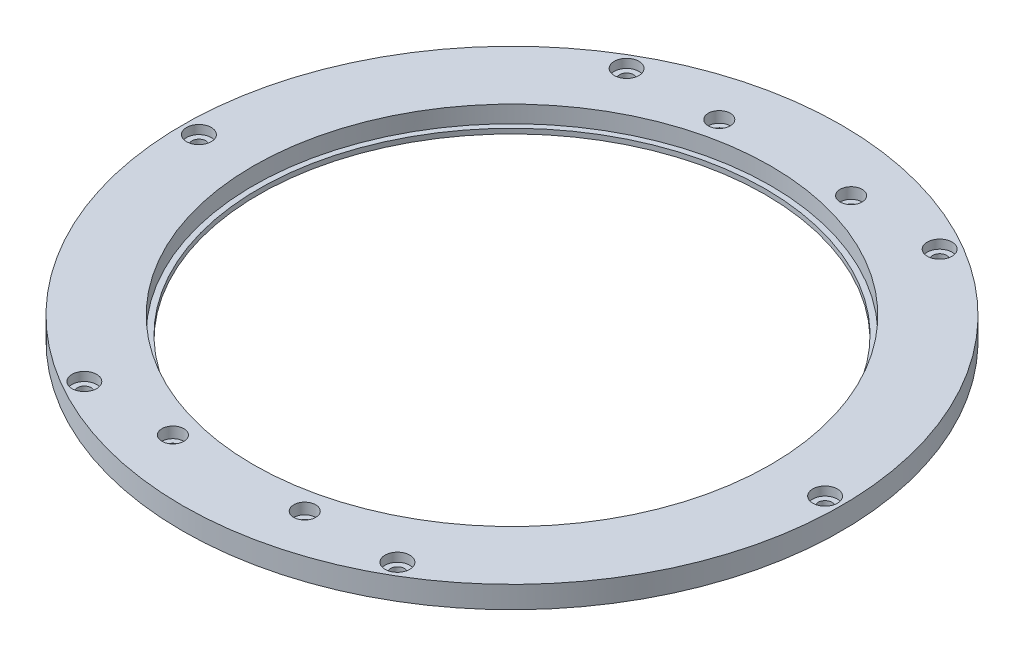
ISO-10303-21;
HEADER;
FILE_DESCRIPTION(('STEP AP214'),'2;1');
FILE_NAME('part.step','',(''),(''),'','','');
FILE_SCHEMA(('AUTOMOTIVE_DESIGN { 1 0 10303 214 1 1 1 1 }'));
ENDSEC;
DATA;
#1=APPLICATION_CONTEXT('core data for automotive mechanical design processes');
#2=APPLICATION_PROTOCOL_DEFINITION('international standard','automotive_design',2000,#1);
#3=PRODUCT_CONTEXT('',#1,'mechanical');
#4=PRODUCT('Part','Part','',(#3));
#5=PRODUCT_RELATED_PRODUCT_CATEGORY('part','',(#4));
#6=PRODUCT_DEFINITION_FORMATION('','',#4);
#7=PRODUCT_DEFINITION_CONTEXT('part definition',#1,'design');
#8=PRODUCT_DEFINITION('design','',#6,#7);
#9=PRODUCT_DEFINITION_SHAPE('','',#8);
#10=(LENGTH_UNIT() NAMED_UNIT(*) SI_UNIT(.MILLI.,.METRE.));
#11=(NAMED_UNIT(*) PLANE_ANGLE_UNIT() SI_UNIT($,.RADIAN.));
#12=(NAMED_UNIT(*) SI_UNIT($,.STERADIAN.) SOLID_ANGLE_UNIT());
#13=UNCERTAINTY_MEASURE_WITH_UNIT(LENGTH_MEASURE(1.E-05),#10,'distance_accuracy_value','');
#14=(GEOMETRIC_REPRESENTATION_CONTEXT(3) GLOBAL_UNCERTAINTY_ASSIGNED_CONTEXT((#13)) GLOBAL_UNIT_ASSIGNED_CONTEXT((#10,
#11,#12)) REPRESENTATION_CONTEXT('',''));
#15=CARTESIAN_POINT('',(0.,0.,0.));
#16=DIRECTION('',(0.,0.,1.));
#17=DIRECTION('',(1.,0.,0.));
#18=AXIS2_PLACEMENT_3D('',#15,#16,#17);
#19=CARTESIAN_POINT('',(-11.9999999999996,4.,-49.7359346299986));
#20=DIRECTION('',(0.,-1.,0.));
#21=DIRECTION('',(0.,0.,-1.));
#22=AXIS2_PLACEMENT_3D('',#19,#20,#21);
#23=CYLINDRICAL_SURFACE('',#22,1.00000000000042);
#24=CARTESIAN_POINT('',(-11.9999999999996,0.,-49.7359346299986));
#25=DIRECTION('',(0.,-1.,0.));
#26=DIRECTION('',(0.,0.,-1.));
#27=AXIS2_PLACEMENT_3D('',#24,#25,#26);
#28=CIRCLE('',#27,1.00000000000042);
#29=CARTESIAN_POINT('',(-11.9999999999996,0.,-50.735934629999));
#30=VERTEX_POINT('',#29);
#31=EDGE_CURVE('E100',#30,#30,#28,.T.);
#32=ORIENTED_EDGE('',*,*,#31,.T.);
#33=EDGE_LOOP('',(#32));
#34=FACE_BOUND('',#33,.T.);
#35=CARTESIAN_POINT('',(-11.9999999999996,2.,-49.7359346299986));
#36=DIRECTION('',(0.,1.,0.));
#37=DIRECTION('',(0.,0.,1.));
#38=AXIS2_PLACEMENT_3D('',#35,#36,#37);
#39=CIRCLE('',#38,1.00000000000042);
#40=CARTESIAN_POINT('',(-11.9999999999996,2.,-48.7359346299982));
#41=VERTEX_POINT('',#40);
#42=EDGE_CURVE('E39',#41,#41,#39,.F.);
#43=ORIENTED_EDGE('',*,*,#42,.F.);
#44=EDGE_LOOP('',(#43));
#45=FACE_BOUND('',#44,.T.);
#46=ADVANCED_FACE('F35',(#34,#45),#23,.F.);
#47=CARTESIAN_POINT('',(12.0000000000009,4.,49.7359346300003));
#48=DIRECTION('',(0.,-1.,0.));
#49=DIRECTION('',(0.,0.,-1.));
#50=AXIS2_PLACEMENT_3D('',#47,#48,#49);
#51=CYLINDRICAL_SURFACE('',#50,1.);
#52=CARTESIAN_POINT('',(12.0000000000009,0.,49.7359346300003));
#53=DIRECTION('',(0.,-1.,0.));
#54=DIRECTION('',(0.,0.,-1.));
#55=AXIS2_PLACEMENT_3D('',#52,#53,#54);
#56=CIRCLE('',#55,1.);
#57=CARTESIAN_POINT('',(12.0000000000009,0.,48.7359346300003));
#58=VERTEX_POINT('',#57);
#59=EDGE_CURVE('E84',#58,#58,#56,.T.);
#60=ORIENTED_EDGE('',*,*,#59,.T.);
#61=EDGE_LOOP('',(#60));
#62=FACE_BOUND('',#61,.T.);
#63=CARTESIAN_POINT('',(12.0000000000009,2.,49.7359346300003));
#64=DIRECTION('',(0.,1.,0.));
#65=DIRECTION('',(0.,0.,1.));
#66=AXIS2_PLACEMENT_3D('',#63,#64,#65);
#67=CIRCLE('',#66,1.);
#68=CARTESIAN_POINT('',(12.0000000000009,2.,50.7359346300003));
#69=VERTEX_POINT('',#68);
#70=EDGE_CURVE('E79',#69,#69,#67,.F.);
#71=ORIENTED_EDGE('',*,*,#70,.F.);
#72=EDGE_LOOP('',(#71));
#73=FACE_BOUND('',#72,.T.);
#74=ADVANCED_FACE('F187',(#62,#73),#51,.F.);
#75=CARTESIAN_POINT('',(-11.9999999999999,4.,49.7359346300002));
#76=DIRECTION('',(0.,-1.,0.));
#77=DIRECTION('',(0.,0.,-1.));
#78=AXIS2_PLACEMENT_3D('',#75,#76,#77);
#79=CYLINDRICAL_SURFACE('',#78,0.999999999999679);
#80=CARTESIAN_POINT('',(-11.9999999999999,0.,49.7359346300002));
#81=DIRECTION('',(0.,-1.,0.));
#82=DIRECTION('',(0.,0.,-1.));
#83=AXIS2_PLACEMENT_3D('',#80,#81,#82);
#84=CIRCLE('',#83,0.999999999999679);
#85=CARTESIAN_POINT('',(-11.9999999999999,0.,48.7359346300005));
#86=VERTEX_POINT('',#85);
#87=EDGE_CURVE('E88',#86,#86,#84,.T.);
#88=ORIENTED_EDGE('',*,*,#87,.T.);
#89=EDGE_LOOP('',(#88));
#90=FACE_BOUND('',#89,.T.);
#91=CARTESIAN_POINT('',(-11.9999999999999,2.,49.7359346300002));
#92=DIRECTION('',(0.,1.,0.));
#93=DIRECTION('',(0.,0.,1.));
#94=AXIS2_PLACEMENT_3D('',#91,#92,#93);
#95=CIRCLE('',#94,0.999999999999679);
#96=CARTESIAN_POINT('',(-11.9999999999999,2.,50.7359346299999));
#97=VERTEX_POINT('',#96);
#98=EDGE_CURVE('E76',#97,#97,#95,.F.);
#99=ORIENTED_EDGE('',*,*,#98,.F.);
#100=EDGE_LOOP('',(#99));
#101=FACE_BOUND('',#100,.T.);
#102=ADVANCED_FACE('F193',(#90,#101),#79,.F.);
#103=CARTESIAN_POINT('',(12.0000000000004,4.,-49.7359346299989));
#104=DIRECTION('',(0.,-1.,0.));
#105=DIRECTION('',(0.,0.,-1.));
#106=AXIS2_PLACEMENT_3D('',#103,#104,#105);
#107=CYLINDRICAL_SURFACE('',#106,1.00000000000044);
#108=CARTESIAN_POINT('',(12.0000000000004,0.,-49.7359346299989));
#109=DIRECTION('',(0.,-1.,0.));
#110=DIRECTION('',(0.,0.,-1.));
#111=AXIS2_PLACEMENT_3D('',#108,#109,#110);
#112=CIRCLE('',#111,1.00000000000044);
#113=CARTESIAN_POINT('',(12.0000000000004,0.,-50.7359346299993));
#114=VERTEX_POINT('',#113);
#115=EDGE_CURVE('E93',#114,#114,#112,.T.);
#116=ORIENTED_EDGE('',*,*,#115,.T.);
#117=EDGE_LOOP('',(#116));
#118=FACE_BOUND('',#117,.T.);
#119=CARTESIAN_POINT('',(12.0000000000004,2.,-49.7359346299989));
#120=DIRECTION('',(0.,1.,0.));
#121=DIRECTION('',(0.,0.,1.));
#122=AXIS2_PLACEMENT_3D('',#119,#120,#121);
#123=CIRCLE('',#122,1.00000000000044);
#124=CARTESIAN_POINT('',(12.0000000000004,2.,-48.7359346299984));
#125=VERTEX_POINT('',#124);
#126=EDGE_CURVE('E73',#125,#125,#123,.F.);
#127=ORIENTED_EDGE('',*,*,#126,.F.);
#128=EDGE_LOOP('',(#127));
#129=FACE_BOUND('',#128,.T.);
#130=ADVANCED_FACE('F271',(#118,#129),#107,.F.);
#131=CARTESIAN_POINT('',(-28.4999999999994,4.,49.3634480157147));
#132=DIRECTION('',(0.,-1.,0.));
#133=DIRECTION('',(0.,0.,-1.));
#134=AXIS2_PLACEMENT_3D('',#131,#132,#133);
#135=CYLINDRICAL_SURFACE('',#134,1.25);
#136=CARTESIAN_POINT('',(-28.4999999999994,0.,49.3634480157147));
#137=DIRECTION('',(0.,-1.,0.));
#138=DIRECTION('',(0.,0.,-1.));
#139=AXIS2_PLACEMENT_3D('',#136,#137,#138);
#140=CIRCLE('',#139,1.25);
#141=CARTESIAN_POINT('',(-28.4999999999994,0.,48.1134480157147));
#142=VERTEX_POINT('',#141);
#143=EDGE_CURVE('E142',#142,#142,#140,.T.);
#144=ORIENTED_EDGE('',*,*,#143,.T.);
#145=EDGE_LOOP('',(#144));
#146=FACE_BOUND('',#145,.T.);
#147=CARTESIAN_POINT('',(-28.4999999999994,2.4,49.3634480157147));
#148=DIRECTION('',(0.,1.,0.));
#149=DIRECTION('',(0.,0.,1.));
#150=AXIS2_PLACEMENT_3D('',#147,#148,#149);
#151=CIRCLE('',#150,1.25);
#152=CARTESIAN_POINT('',(-28.4999999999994,2.4,50.6134480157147));
#153=VERTEX_POINT('',#152);
#154=EDGE_CURVE('E69',#153,#153,#151,.F.);
#155=ORIENTED_EDGE('',*,*,#154,.F.);
#156=EDGE_LOOP('',(#155));
#157=FACE_BOUND('',#156,.T.);
#158=ADVANCED_FACE('F253',(#146,#157),#135,.F.);
#159=CARTESIAN_POINT('',(-56.9999999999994,4.,1.72084568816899E-12));
#160=DIRECTION('',(0.,-1.,0.));
#161=DIRECTION('',(0.,0.,-1.));
#162=AXIS2_PLACEMENT_3D('',#159,#160,#161);
#163=CYLINDRICAL_SURFACE('',#162,1.25);
#164=CARTESIAN_POINT('',(-56.9999999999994,0.,1.72084568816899E-12));
#165=DIRECTION('',(0.,-1.,0.));
#166=DIRECTION('',(0.,0.,-1.));
#167=AXIS2_PLACEMENT_3D('',#164,#165,#166);
#168=CIRCLE('',#167,1.25);
#169=CARTESIAN_POINT('',(-56.9999999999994,0.,-1.24999999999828));
#170=VERTEX_POINT('',#169);
#171=EDGE_CURVE('E139',#170,#170,#168,.T.);
#172=ORIENTED_EDGE('',*,*,#171,.T.);
#173=EDGE_LOOP('',(#172));
#174=FACE_BOUND('',#173,.T.);
#175=CARTESIAN_POINT('',(-56.9999999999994,2.4,1.72084568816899E-12));
#176=DIRECTION('',(0.,1.,0.));
#177=DIRECTION('',(0.,0.,1.));
#178=AXIS2_PLACEMENT_3D('',#175,#176,#177);
#179=CIRCLE('',#178,1.25);
#180=CARTESIAN_POINT('',(-56.9999999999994,2.4,1.25000000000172));
#181=VERTEX_POINT('',#180);
#182=EDGE_CURVE('E66',#181,#181,#179,.F.);
#183=ORIENTED_EDGE('',*,*,#182,.F.);
#184=EDGE_LOOP('',(#183));
#185=FACE_BOUND('',#184,.T.);
#186=ADVANCED_FACE('F249',(#174,#185),#163,.F.);
#187=CARTESIAN_POINT('',(-28.4999999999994,4.,-49.3634480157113));
#188=DIRECTION('',(0.,-1.,0.));
#189=DIRECTION('',(0.,0.,-1.));
#190=AXIS2_PLACEMENT_3D('',#187,#188,#189);
#191=CYLINDRICAL_SURFACE('',#190,1.25);
#192=CARTESIAN_POINT('',(-28.4999999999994,0.,-49.3634480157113));
#193=DIRECTION('',(0.,-1.,0.));
#194=DIRECTION('',(0.,0.,-1.));
#195=AXIS2_PLACEMENT_3D('',#192,#193,#194);
#196=CIRCLE('',#195,1.25);
#197=CARTESIAN_POINT('',(-28.4999999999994,0.,-50.6134480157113));
#198=VERTEX_POINT('',#197);
#199=EDGE_CURVE('E143',#198,#198,#196,.T.);
#200=ORIENTED_EDGE('',*,*,#199,.T.);
#201=EDGE_LOOP('',(#200));
#202=FACE_BOUND('',#201,.T.);
#203=CARTESIAN_POINT('',(-28.4999999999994,2.4,-49.3634480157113));
#204=DIRECTION('',(0.,1.,0.));
#205=DIRECTION('',(0.,0.,1.));
#206=AXIS2_PLACEMENT_3D('',#203,#204,#205);
#207=CIRCLE('',#206,1.25);
#208=CARTESIAN_POINT('',(-28.4999999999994,2.4,-48.1134480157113));
#209=VERTEX_POINT('',#208);
#210=EDGE_CURVE('E63',#209,#209,#207,.F.);
#211=ORIENTED_EDGE('',*,*,#210,.F.);
#212=EDGE_LOOP('',(#211));
#213=FACE_BOUND('',#212,.T.);
#214=ADVANCED_FACE('F252',(#202,#213),#191,.F.);
#215=CARTESIAN_POINT('',(28.5000000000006,4.,-49.3634480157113));
#216=DIRECTION('',(0.,-1.,0.));
#217=DIRECTION('',(0.,0.,-1.));
#218=AXIS2_PLACEMENT_3D('',#215,#216,#217);
#219=CYLINDRICAL_SURFACE('',#218,1.25);
#220=CARTESIAN_POINT('',(28.5000000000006,0.,-49.3634480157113));
#221=DIRECTION('',(0.,-1.,0.));
#222=DIRECTION('',(0.,0.,-1.));
#223=AXIS2_PLACEMENT_3D('',#220,#221,#222);
#224=CIRCLE('',#223,1.25);
#225=CARTESIAN_POINT('',(28.5000000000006,0.,-50.6134480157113));
#226=VERTEX_POINT('',#225);
#227=EDGE_CURVE('E146',#226,#226,#224,.T.);
#228=ORIENTED_EDGE('',*,*,#227,.T.);
#229=EDGE_LOOP('',(#228));
#230=FACE_BOUND('',#229,.T.);
#231=CARTESIAN_POINT('',(28.5000000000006,2.4,-49.3634480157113));
#232=DIRECTION('',(0.,1.,0.));
#233=DIRECTION('',(0.,0.,1.));
#234=AXIS2_PLACEMENT_3D('',#231,#232,#233);
#235=CIRCLE('',#234,1.25);
#236=CARTESIAN_POINT('',(28.5000000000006,2.4,-48.1134480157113));
#237=VERTEX_POINT('',#236);
#238=EDGE_CURVE('E60',#237,#237,#235,.F.);
#239=ORIENTED_EDGE('',*,*,#238,.F.);
#240=EDGE_LOOP('',(#239));
#241=FACE_BOUND('',#240,.T.);
#242=ADVANCED_FACE('F257',(#230,#241),#219,.F.);
#243=CARTESIAN_POINT('',(57.0000000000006,4.,1.71390679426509E-12));
#244=DIRECTION('',(0.,-1.,0.));
#245=DIRECTION('',(0.,0.,-1.));
#246=AXIS2_PLACEMENT_3D('',#243,#244,#245);
#247=CYLINDRICAL_SURFACE('',#246,1.25);
#248=CARTESIAN_POINT('',(57.0000000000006,0.,1.71390679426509E-12));
#249=DIRECTION('',(0.,-1.,0.));
#250=DIRECTION('',(0.,0.,-1.));
#251=AXIS2_PLACEMENT_3D('',#248,#249,#250);
#252=CIRCLE('',#251,1.25);
#253=CARTESIAN_POINT('',(57.0000000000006,0.,-1.24999999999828));
#254=VERTEX_POINT('',#253);
#255=EDGE_CURVE('E149',#254,#254,#252,.T.);
#256=ORIENTED_EDGE('',*,*,#255,.T.);
#257=EDGE_LOOP('',(#256));
#258=FACE_BOUND('',#257,.T.);
#259=CARTESIAN_POINT('',(57.0000000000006,2.4,1.71390679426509E-12));
#260=DIRECTION('',(0.,1.,0.));
#261=DIRECTION('',(0.,0.,1.));
#262=AXIS2_PLACEMENT_3D('',#259,#260,#261);
#263=CIRCLE('',#262,1.25);
#264=CARTESIAN_POINT('',(57.0000000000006,2.4,1.25000000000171));
#265=VERTEX_POINT('',#264);
#266=EDGE_CURVE('E56',#265,#265,#263,.F.);
#267=ORIENTED_EDGE('',*,*,#266,.F.);
#268=EDGE_LOOP('',(#267));
#269=FACE_BOUND('',#268,.T.);
#270=ADVANCED_FACE('F261',(#258,#269),#247,.F.);
#271=CARTESIAN_POINT('',(28.5000000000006,4.,49.3634480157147));
#272=DIRECTION('',(0.,-1.,0.));
#273=DIRECTION('',(0.,0.,-1.));
#274=AXIS2_PLACEMENT_3D('',#271,#272,#273);
#275=CYLINDRICAL_SURFACE('',#274,1.25);
#276=CARTESIAN_POINT('',(28.5000000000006,0.,49.3634480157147));
#277=DIRECTION('',(0.,-1.,0.));
#278=DIRECTION('',(0.,0.,-1.));
#279=AXIS2_PLACEMENT_3D('',#276,#277,#278);
#280=CIRCLE('',#279,1.25);
#281=CARTESIAN_POINT('',(28.5000000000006,0.,48.1134480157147));
#282=VERTEX_POINT('',#281);
#283=EDGE_CURVE('E72',#282,#282,#280,.T.);
#284=ORIENTED_EDGE('',*,*,#283,.T.);
#285=EDGE_LOOP('',(#284));
#286=FACE_BOUND('',#285,.T.);
#287=CARTESIAN_POINT('',(28.5000000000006,2.4,49.3634480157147));
#288=DIRECTION('',(0.,1.,0.));
#289=DIRECTION('',(0.,0.,1.));
#290=AXIS2_PLACEMENT_3D('',#287,#288,#289);
#291=CIRCLE('',#290,1.25);
#292=CARTESIAN_POINT('',(28.5000000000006,2.4,50.6134480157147));
#293=VERTEX_POINT('',#292);
#294=EDGE_CURVE('E53',#293,#293,#291,.F.);
#295=ORIENTED_EDGE('',*,*,#294,.F.);
#296=EDGE_LOOP('',(#295));
#297=FACE_BOUND('',#296,.T.);
#298=ADVANCED_FACE('F182',(#286,#297),#275,.F.);
#299=CARTESIAN_POINT('',(0.,4.,0.));
#300=DIRECTION('',(0.,-1.,0.));
#301=DIRECTION('',(0.,0.,-1.));
#302=AXIS2_PLACEMENT_3D('',#299,#300,#301);
#303=CYLINDRICAL_SURFACE('',#302,47.1);
#304=CARTESIAN_POINT('',(0.,4.,0.));
#305=DIRECTION('',(0.,1.,0.));
#306=DIRECTION('',(0.,0.,1.));
#307=AXIS2_PLACEMENT_3D('',#304,#305,#306);
#308=CIRCLE('',#307,47.1);
#309=CARTESIAN_POINT('',(0.,4.,47.1));
#310=VERTEX_POINT('',#309);
#311=EDGE_CURVE('E48',#310,#310,#308,.T.);
#312=ORIENTED_EDGE('',*,*,#311,.T.);
#313=EDGE_LOOP('',(#312));
#314=FACE_BOUND('',#313,.T.);
#315=CARTESIAN_POINT('',(0.,0.9,0.));
#316=DIRECTION('',(0.,-1.,0.));
#317=DIRECTION('',(0.,0.,-1.));
#318=AXIS2_PLACEMENT_3D('',#315,#316,#317);
#319=CIRCLE('',#318,47.1);
#320=CARTESIAN_POINT('',(0.,0.9,-47.1));
#321=VERTEX_POINT('',#320);
#322=EDGE_CURVE('E160',#321,#321,#319,.T.);
#323=ORIENTED_EDGE('',*,*,#322,.T.);
#324=EDGE_LOOP('',(#323));
#325=FACE_BOUND('',#324,.T.);
#326=ADVANCED_FACE('F168',(#314,#325),#303,.F.);
#327=CARTESIAN_POINT('',(0.,4.,0.));
#328=DIRECTION('',(0.,1.,0.));
#329=DIRECTION('',(0.,0.,1.));
#330=AXIS2_PLACEMENT_3D('',#327,#328,#329);
#331=PLANE('',#330);
#332=CARTESIAN_POINT('',(12.0000000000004,4.,-49.7359346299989));
#333=DIRECTION('',(0.,1.,0.));
#334=DIRECTION('',(0.,0.,1.));
#335=AXIS2_PLACEMENT_3D('',#332,#333,#334);
#336=CIRCLE('',#335,2.);
#337=CARTESIAN_POINT('',(12.0000000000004,4.,-47.7359346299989));
#338=VERTEX_POINT('',#337);
#339=EDGE_CURVE('E502',#338,#338,#336,.T.);
#340=ORIENTED_EDGE('',*,*,#339,.F.);
#341=EDGE_LOOP('',(#340));
#342=FACE_BOUND('',#341,.T.);
#343=CARTESIAN_POINT('',(-11.9999999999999,4.,49.7359346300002));
#344=DIRECTION('',(0.,1.,0.));
#345=DIRECTION('',(0.,0.,1.));
#346=AXIS2_PLACEMENT_3D('',#343,#344,#345);
#347=CIRCLE('',#346,2.);
#348=CARTESIAN_POINT('',(-11.9999999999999,4.,51.7359346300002));
#349=VERTEX_POINT('',#348);
#350=EDGE_CURVE('E514',#349,#349,#347,.T.);
#351=ORIENTED_EDGE('',*,*,#350,.F.);
#352=EDGE_LOOP('',(#351));
#353=FACE_BOUND('',#352,.T.);
#354=CARTESIAN_POINT('',(12.0000000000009,4.,49.7359346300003));
#355=DIRECTION('',(0.,1.,0.));
#356=DIRECTION('',(0.,0.,1.));
#357=AXIS2_PLACEMENT_3D('',#354,#355,#356);
#358=CIRCLE('',#357,2.);
#359=CARTESIAN_POINT('',(12.0000000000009,4.,51.7359346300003));
#360=VERTEX_POINT('',#359);
#361=EDGE_CURVE('E509',#360,#360,#358,.T.);
#362=ORIENTED_EDGE('',*,*,#361,.F.);
#363=EDGE_LOOP('',(#362));
#364=FACE_BOUND('',#363,.T.);
#365=CARTESIAN_POINT('',(-11.9999999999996,4.,-49.7359346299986));
#366=DIRECTION('',(0.,1.,0.));
#367=DIRECTION('',(0.,0.,1.));
#368=AXIS2_PLACEMENT_3D('',#365,#366,#367);
#369=CIRCLE('',#368,2.);
#370=CARTESIAN_POINT('',(-11.9999999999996,4.,-47.7359346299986));
#371=VERTEX_POINT('',#370);
#372=EDGE_CURVE('E97',#371,#371,#369,.T.);
#373=ORIENTED_EDGE('',*,*,#372,.F.);
#374=EDGE_LOOP('',(#373));
#375=FACE_BOUND('',#374,.T.);
#376=CARTESIAN_POINT('',(-56.9999999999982,4.,4.05925293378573E-13));
#377=DIRECTION('',(0.,1.,0.));
#378=DIRECTION('',(0.,0.,1.));
#379=AXIS2_PLACEMENT_3D('',#376,#377,#378);
#380=CIRCLE('',#379,2.25);
#381=CARTESIAN_POINT('',(-56.9999999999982,4.,2.25000000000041));
#382=VERTEX_POINT('',#381);
#383=EDGE_CURVE('E104',#382,#382,#380,.T.);
#384=ORIENTED_EDGE('',*,*,#383,.F.);
#385=EDGE_LOOP('',(#384));
#386=FACE_BOUND('',#385,.T.);
#387=CARTESIAN_POINT('',(-28.4999999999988,4.,49.3634480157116));
#388=DIRECTION('',(0.,1.,0.));
#389=DIRECTION('',(0.,0.,1.));
#390=AXIS2_PLACEMENT_3D('',#387,#388,#389);
#391=CIRCLE('',#390,2.25);
#392=CARTESIAN_POINT('',(-28.4999999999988,4.,51.6134480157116));
#393=VERTEX_POINT('',#392);
#394=EDGE_CURVE('E127',#393,#393,#391,.T.);
#395=ORIENTED_EDGE('',*,*,#394,.F.);
#396=EDGE_LOOP('',(#395));
#397=FACE_BOUND('',#396,.T.);
#398=CARTESIAN_POINT('',(28.4999999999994,4.,49.3634480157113));
#399=DIRECTION('',(0.,1.,0.));
#400=DIRECTION('',(0.,0.,1.));
#401=AXIS2_PLACEMENT_3D('',#398,#399,#400);
#402=CIRCLE('',#401,2.25);
#403=CARTESIAN_POINT('',(28.4999999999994,4.,51.6134480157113));
#404=VERTEX_POINT('',#403);
#405=EDGE_CURVE('E121',#404,#404,#402,.T.);
#406=ORIENTED_EDGE('',*,*,#405,.F.);
#407=EDGE_LOOP('',(#406));
#408=FACE_BOUND('',#407,.T.);
#409=CARTESIAN_POINT('',(56.9999999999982,4.,-3.7470027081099E-13));
#410=DIRECTION('',(0.,1.,0.));
#411=DIRECTION('',(0.,0.,1.));
#412=AXIS2_PLACEMENT_3D('',#409,#410,#411);
#413=CIRCLE('',#412,2.24999999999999);
#414=CARTESIAN_POINT('',(56.9999999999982,4.,2.24999999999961));
#415=VERTEX_POINT('',#414);
#416=EDGE_CURVE('E115',#415,#415,#413,.T.);
#417=ORIENTED_EDGE('',*,*,#416,.F.);
#418=EDGE_LOOP('',(#417));
#419=FACE_BOUND('',#418,.T.);
#420=CARTESIAN_POINT('',(28.4999999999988,4.,-49.3634480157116));
#421=DIRECTION('',(0.,1.,0.));
#422=DIRECTION('',(0.,0.,1.));
#423=AXIS2_PLACEMENT_3D('',#420,#421,#422);
#424=CIRCLE('',#423,2.25);
#425=CARTESIAN_POINT('',(28.4999999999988,4.,-47.1134480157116));
#426=VERTEX_POINT('',#425);
#427=EDGE_CURVE('E109',#426,#426,#424,.T.);
#428=ORIENTED_EDGE('',*,*,#427,.F.);
#429=EDGE_LOOP('',(#428));
#430=FACE_BOUND('',#429,.T.);
#431=CARTESIAN_POINT('',(-28.4999999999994,4.,-49.3634480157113));
#432=DIRECTION('',(0.,1.,0.));
#433=DIRECTION('',(0.,0.,1.));
#434=AXIS2_PLACEMENT_3D('',#431,#432,#433);
#435=CIRCLE('',#434,2.25);
#436=CARTESIAN_POINT('',(-28.4999999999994,4.,-47.1134480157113));
#437=VERTEX_POINT('',#436);
#438=EDGE_CURVE('E108',#437,#437,#435,.T.);
#439=ORIENTED_EDGE('',*,*,#438,.F.);
#440=EDGE_LOOP('',(#439));
#441=FACE_BOUND('',#440,.T.);
#442=CARTESIAN_POINT('',(0.,4.,0.));
#443=DIRECTION('',(0.,1.,0.));
#444=DIRECTION('',(0.,0.,1.));
#445=AXIS2_PLACEMENT_3D('',#442,#443,#444);
#446=CIRCLE('',#445,60.);
#447=CARTESIAN_POINT('',(0.,4.,60.));
#448=VERTEX_POINT('',#447);
#449=EDGE_CURVE('E10',#448,#448,#446,.T.);
#450=ORIENTED_EDGE('',*,*,#449,.T.);
#451=EDGE_LOOP('',(#450));
#452=FACE_BOUND('',#451,.T.);
#453=ORIENTED_EDGE('',*,*,#311,.F.);
#454=EDGE_LOOP('',(#453));
#455=FACE_BOUND('',#454,.T.);
#456=ADVANCED_FACE('F170',(#342,#353,#364,#375,#386,#397,#408,#419,#430,#441,#452,#455),#331,.T.);
#457=CARTESIAN_POINT('',(0.,0.,0.));
#458=DIRECTION('',(0.,1.,0.));
#459=DIRECTION('',(0.,0.,1.));
#460=AXIS2_PLACEMENT_3D('',#457,#458,#459);
#461=PLANE('',#460);
#462=ORIENTED_EDGE('',*,*,#115,.F.);
#463=EDGE_LOOP('',(#462));
#464=FACE_BOUND('',#463,.T.);
#465=ORIENTED_EDGE('',*,*,#87,.F.);
#466=EDGE_LOOP('',(#465));
#467=FACE_BOUND('',#466,.T.);
#468=ORIENTED_EDGE('',*,*,#59,.F.);
#469=EDGE_LOOP('',(#468));
#470=FACE_BOUND('',#469,.T.);
#471=ORIENTED_EDGE('',*,*,#31,.F.);
#472=EDGE_LOOP('',(#471));
#473=FACE_BOUND('',#472,.T.);
#474=ORIENTED_EDGE('',*,*,#283,.F.);
#475=EDGE_LOOP('',(#474));
#476=FACE_BOUND('',#475,.T.);
#477=ORIENTED_EDGE('',*,*,#255,.F.);
#478=EDGE_LOOP('',(#477));
#479=FACE_BOUND('',#478,.T.);
#480=ORIENTED_EDGE('',*,*,#227,.F.);
#481=EDGE_LOOP('',(#480));
#482=FACE_BOUND('',#481,.T.);
#483=ORIENTED_EDGE('',*,*,#199,.F.);
#484=EDGE_LOOP('',(#483));
#485=FACE_BOUND('',#484,.T.);
#486=ORIENTED_EDGE('',*,*,#171,.F.);
#487=EDGE_LOOP('',(#486));
#488=FACE_BOUND('',#487,.T.);
#489=ORIENTED_EDGE('',*,*,#143,.F.);
#490=EDGE_LOOP('',(#489));
#491=FACE_BOUND('',#490,.T.);
#492=CARTESIAN_POINT('',(0.,0.,0.));
#493=DIRECTION('',(0.,1.,0.));
#494=DIRECTION('',(0.,0.,1.));
#495=AXIS2_PLACEMENT_3D('',#492,#493,#494);
#496=CIRCLE('',#495,60.);
#497=CARTESIAN_POINT('',(0.,0.,60.));
#498=VERTEX_POINT('',#497);
#499=EDGE_CURVE('E43',#498,#498,#496,.T.);
#500=ORIENTED_EDGE('',*,*,#499,.F.);
#501=EDGE_LOOP('',(#500));
#502=FACE_BOUND('',#501,.T.);
#503=CARTESIAN_POINT('',(0.,0.,0.));
#504=DIRECTION('',(0.,-1.,0.));
#505=DIRECTION('',(0.,0.,-1.));
#506=AXIS2_PLACEMENT_3D('',#503,#504,#505);
#507=CIRCLE('',#506,46.1);
#508=CARTESIAN_POINT('',(0.,0.,-46.1));
#509=VERTEX_POINT('',#508);
#510=EDGE_CURVE('E156',#509,#509,#507,.T.);
#511=ORIENTED_EDGE('',*,*,#510,.F.);
#512=EDGE_LOOP('',(#511));
#513=FACE_BOUND('',#512,.T.);
#514=ADVANCED_FACE('F172',(#464,#467,#470,#473,#476,#479,#482,#485,#488,#491,#502,#513),#461,.F.);
#515=CARTESIAN_POINT('',(0.,4.,0.));
#516=DIRECTION('',(0.,-1.,0.));
#517=DIRECTION('',(0.,0.,-1.));
#518=AXIS2_PLACEMENT_3D('',#515,#516,#517);
#519=CYLINDRICAL_SURFACE('',#518,60.);
#520=ORIENTED_EDGE('',*,*,#449,.F.);
#521=EDGE_LOOP('',(#520));
#522=FACE_BOUND('',#521,.T.);
#523=ORIENTED_EDGE('',*,*,#499,.T.);
#524=EDGE_LOOP('',(#523));
#525=FACE_BOUND('',#524,.T.);
#526=ADVANCED_FACE('F37',(#522,#525),#519,.T.);
#527=CARTESIAN_POINT('',(0.,0.9,0.));
#528=DIRECTION('',(0.,-1.,0.));
#529=DIRECTION('',(0.,0.,-1.));
#530=AXIS2_PLACEMENT_3D('',#527,#528,#529);
#531=PLANE('',#530);
#532=CARTESIAN_POINT('',(0.,0.9,0.));
#533=DIRECTION('',(0.,-1.,0.));
#534=DIRECTION('',(0.,0.,-1.));
#535=AXIS2_PLACEMENT_3D('',#532,#533,#534);
#536=CIRCLE('',#535,46.1);
#537=CARTESIAN_POINT('',(0.,0.9,-46.1));
#538=VERTEX_POINT('',#537);
#539=EDGE_CURVE('E157',#538,#538,#536,.T.);
#540=ORIENTED_EDGE('',*,*,#539,.T.);
#541=EDGE_LOOP('',(#540));
#542=FACE_BOUND('',#541,.T.);
#543=ORIENTED_EDGE('',*,*,#322,.F.);
#544=EDGE_LOOP('',(#543));
#545=FACE_BOUND('',#544,.T.);
#546=ADVANCED_FACE('F275',(#542,#545),#531,.F.);
#547=CARTESIAN_POINT('',(0.,0.9,0.));
#548=DIRECTION('',(0.,-1.,0.));
#549=DIRECTION('',(0.,0.,-1.));
#550=AXIS2_PLACEMENT_3D('',#547,#548,#549);
#551=CYLINDRICAL_SURFACE('',#550,46.1);
#552=ORIENTED_EDGE('',*,*,#539,.F.);
#553=EDGE_LOOP('',(#552));
#554=FACE_BOUND('',#553,.T.);
#555=ORIENTED_EDGE('',*,*,#510,.T.);
#556=EDGE_LOOP('',(#555));
#557=FACE_BOUND('',#556,.T.);
#558=ADVANCED_FACE('F220',(#554,#557),#551,.F.);
#559=CARTESIAN_POINT('',(28.4999999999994,2.4,49.3634480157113));
#560=DIRECTION('',(0.,1.,0.));
#561=DIRECTION('',(0.,0.,1.));
#562=AXIS2_PLACEMENT_3D('',#559,#560,#561);
#563=PLANE('',#562);
#564=CARTESIAN_POINT('',(28.4999999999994,2.4,49.3634480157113));
#565=DIRECTION('',(0.,1.,0.));
#566=DIRECTION('',(0.,0.,1.));
#567=AXIS2_PLACEMENT_3D('',#564,#565,#566);
#568=CIRCLE('',#567,2.25);
#569=CARTESIAN_POINT('',(28.4999999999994,2.4,51.6134480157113));
#570=VERTEX_POINT('',#569);
#571=EDGE_CURVE('E118',#570,#570,#568,.T.);
#572=ORIENTED_EDGE('',*,*,#571,.T.);
#573=EDGE_LOOP('',(#572));
#574=FACE_BOUND('',#573,.T.);
#575=ORIENTED_EDGE('',*,*,#294,.T.);
#576=EDGE_LOOP('',(#575));
#577=FACE_BOUND('',#576,.T.);
#578=ADVANCED_FACE('F217',(#574,#577),#563,.T.);
#579=CARTESIAN_POINT('',(28.4999999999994,2.4,49.3634480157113));
#580=DIRECTION('',(0.,1.,0.));
#581=DIRECTION('',(0.,0.,1.));
#582=AXIS2_PLACEMENT_3D('',#579,#580,#581);
#583=CYLINDRICAL_SURFACE('',#582,2.25);
#584=ORIENTED_EDGE('',*,*,#571,.F.);
#585=EDGE_LOOP('',(#584));
#586=FACE_BOUND('',#585,.T.);
#587=ORIENTED_EDGE('',*,*,#405,.T.);
#588=EDGE_LOOP('',(#587));
#589=FACE_BOUND('',#588,.T.);
#590=ADVANCED_FACE('F212',(#586,#589),#583,.F.);
#591=CARTESIAN_POINT('',(56.9999999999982,2.4,-3.7470027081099E-13));
#592=DIRECTION('',(0.,1.,0.));
#593=DIRECTION('',(0.,0.,1.));
#594=AXIS2_PLACEMENT_3D('',#591,#592,#593);
#595=PLANE('',#594);
#596=CARTESIAN_POINT('',(56.9999999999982,2.4,-3.7470027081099E-13));
#597=DIRECTION('',(0.,1.,0.));
#598=DIRECTION('',(0.,0.,1.));
#599=AXIS2_PLACEMENT_3D('',#596,#597,#598);
#600=CIRCLE('',#599,2.24999999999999);
#601=CARTESIAN_POINT('',(56.9999999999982,2.4,2.24999999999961));
#602=VERTEX_POINT('',#601);
#603=EDGE_CURVE('E112',#602,#602,#600,.T.);
#604=ORIENTED_EDGE('',*,*,#603,.T.);
#605=EDGE_LOOP('',(#604));
#606=FACE_BOUND('',#605,.T.);
#607=ORIENTED_EDGE('',*,*,#266,.T.);
#608=EDGE_LOOP('',(#607));
#609=FACE_BOUND('',#608,.T.);
#610=ADVANCED_FACE('F209',(#606,#609),#595,.T.);
#611=CARTESIAN_POINT('',(56.9999999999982,2.4,-3.7470027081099E-13));
#612=DIRECTION('',(0.,1.,0.));
#613=DIRECTION('',(0.,0.,1.));
#614=AXIS2_PLACEMENT_3D('',#611,#612,#613);
#615=CYLINDRICAL_SURFACE('',#614,2.24999999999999);
#616=ORIENTED_EDGE('',*,*,#603,.F.);
#617=EDGE_LOOP('',(#616));
#618=FACE_BOUND('',#617,.T.);
#619=ORIENTED_EDGE('',*,*,#416,.T.);
#620=EDGE_LOOP('',(#619));
#621=FACE_BOUND('',#620,.T.);
#622=ADVANCED_FACE('F203',(#618,#621),#615,.F.);
#623=CARTESIAN_POINT('',(28.4999999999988,2.4,-49.3634480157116));
#624=DIRECTION('',(0.,1.,0.));
#625=DIRECTION('',(0.,0.,1.));
#626=AXIS2_PLACEMENT_3D('',#623,#624,#625);
#627=PLANE('',#626);
#628=CARTESIAN_POINT('',(28.4999999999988,2.4,-49.3634480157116));
#629=DIRECTION('',(0.,1.,0.));
#630=DIRECTION('',(0.,0.,1.));
#631=AXIS2_PLACEMENT_3D('',#628,#629,#630);
#632=CIRCLE('',#631,2.25);
#633=CARTESIAN_POINT('',(28.4999999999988,2.4,-47.1134480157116));
#634=VERTEX_POINT('',#633);
#635=EDGE_CURVE('E105',#634,#634,#632,.T.);
#636=ORIENTED_EDGE('',*,*,#635,.T.);
#637=EDGE_LOOP('',(#636));
#638=FACE_BOUND('',#637,.T.);
#639=ORIENTED_EDGE('',*,*,#238,.T.);
#640=EDGE_LOOP('',(#639));
#641=FACE_BOUND('',#640,.T.);
#642=ADVANCED_FACE('F199',(#638,#641),#627,.T.);
#643=CARTESIAN_POINT('',(28.4999999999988,2.4,-49.3634480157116));
#644=DIRECTION('',(0.,1.,0.));
#645=DIRECTION('',(0.,0.,1.));
#646=AXIS2_PLACEMENT_3D('',#643,#644,#645);
#647=CYLINDRICAL_SURFACE('',#646,2.25);
#648=ORIENTED_EDGE('',*,*,#635,.F.);
#649=EDGE_LOOP('',(#648));
#650=FACE_BOUND('',#649,.T.);
#651=ORIENTED_EDGE('',*,*,#427,.T.);
#652=EDGE_LOOP('',(#651));
#653=FACE_BOUND('',#652,.T.);
#654=ADVANCED_FACE('F202',(#650,#653),#647,.F.);
#655=CARTESIAN_POINT('',(-28.4999999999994,2.4,-49.3634480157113));
#656=DIRECTION('',(0.,1.,0.));
#657=DIRECTION('',(0.,0.,1.));
#658=AXIS2_PLACEMENT_3D('',#655,#656,#657);
#659=PLANE('',#658);
#660=CARTESIAN_POINT('',(-28.4999999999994,2.4,-49.3634480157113));
#661=DIRECTION('',(0.,1.,0.));
#662=DIRECTION('',(0.,0.,1.));
#663=AXIS2_PLACEMENT_3D('',#660,#661,#662);
#664=CIRCLE('',#663,2.25);
#665=CARTESIAN_POINT('',(-28.4999999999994,2.4,-47.1134480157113));
#666=VERTEX_POINT('',#665);
#667=EDGE_CURVE('E57',#666,#666,#664,.T.);
#668=ORIENTED_EDGE('',*,*,#667,.T.);
#669=EDGE_LOOP('',(#668));
#670=FACE_BOUND('',#669,.T.);
#671=ORIENTED_EDGE('',*,*,#210,.T.);
#672=EDGE_LOOP('',(#671));
#673=FACE_BOUND('',#672,.T.);
#674=ADVANCED_FACE('F207',(#670,#673),#659,.T.);
#675=CARTESIAN_POINT('',(-28.4999999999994,2.4,-49.3634480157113));
#676=DIRECTION('',(0.,1.,0.));
#677=DIRECTION('',(0.,0.,1.));
#678=AXIS2_PLACEMENT_3D('',#675,#676,#677);
#679=CYLINDRICAL_SURFACE('',#678,2.25);
#680=ORIENTED_EDGE('',*,*,#667,.F.);
#681=EDGE_LOOP('',(#680));
#682=FACE_BOUND('',#681,.T.);
#683=ORIENTED_EDGE('',*,*,#438,.T.);
#684=EDGE_LOOP('',(#683));
#685=FACE_BOUND('',#684,.T.);
#686=ADVANCED_FACE('F238',(#682,#685),#679,.F.);
#687=CARTESIAN_POINT('',(-56.9999999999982,2.4,4.05925293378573E-13));
#688=DIRECTION('',(0.,1.,0.));
#689=DIRECTION('',(0.,0.,1.));
#690=AXIS2_PLACEMENT_3D('',#687,#688,#689);
#691=PLANE('',#690);
#692=CARTESIAN_POINT('',(-56.9999999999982,2.4,4.05925293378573E-13));
#693=DIRECTION('',(0.,1.,0.));
#694=DIRECTION('',(0.,0.,1.));
#695=AXIS2_PLACEMENT_3D('',#692,#693,#694);
#696=CIRCLE('',#695,2.25);
#697=CARTESIAN_POINT('',(-56.9999999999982,2.4,2.25000000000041));
#698=VERTEX_POINT('',#697);
#699=EDGE_CURVE('E130',#698,#698,#696,.T.);
#700=ORIENTED_EDGE('',*,*,#699,.T.);
#701=EDGE_LOOP('',(#700));
#702=FACE_BOUND('',#701,.T.);
#703=ORIENTED_EDGE('',*,*,#182,.T.);
#704=EDGE_LOOP('',(#703));
#705=FACE_BOUND('',#704,.T.);
#706=ADVANCED_FACE('F235',(#702,#705),#691,.T.);
#707=CARTESIAN_POINT('',(-56.9999999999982,2.4,4.05925293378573E-13));
#708=DIRECTION('',(0.,1.,0.));
#709=DIRECTION('',(0.,0.,1.));
#710=AXIS2_PLACEMENT_3D('',#707,#708,#709);
#711=CYLINDRICAL_SURFACE('',#710,2.25);
#712=ORIENTED_EDGE('',*,*,#699,.F.);
#713=EDGE_LOOP('',(#712));
#714=FACE_BOUND('',#713,.T.);
#715=ORIENTED_EDGE('',*,*,#383,.T.);
#716=EDGE_LOOP('',(#715));
#717=FACE_BOUND('',#716,.T.);
#718=ADVANCED_FACE('F229',(#714,#717),#711,.F.);
#719=CARTESIAN_POINT('',(-28.4999999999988,2.4,49.3634480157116));
#720=DIRECTION('',(0.,1.,0.));
#721=DIRECTION('',(0.,0.,1.));
#722=AXIS2_PLACEMENT_3D('',#719,#720,#721);
#723=PLANE('',#722);
#724=CARTESIAN_POINT('',(-28.4999999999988,2.4,49.3634480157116));
#725=DIRECTION('',(0.,1.,0.));
#726=DIRECTION('',(0.,0.,1.));
#727=AXIS2_PLACEMENT_3D('',#724,#725,#726);
#728=CIRCLE('',#727,2.25);
#729=CARTESIAN_POINT('',(-28.4999999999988,2.4,51.6134480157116));
#730=VERTEX_POINT('',#729);
#731=EDGE_CURVE('E124',#730,#730,#728,.T.);
#732=ORIENTED_EDGE('',*,*,#731,.T.);
#733=EDGE_LOOP('',(#732));
#734=FACE_BOUND('',#733,.T.);
#735=ORIENTED_EDGE('',*,*,#154,.T.);
#736=EDGE_LOOP('',(#735));
#737=FACE_BOUND('',#736,.T.);
#738=ADVANCED_FACE('F225',(#734,#737),#723,.T.);
#739=CARTESIAN_POINT('',(-28.4999999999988,2.4,49.3634480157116));
#740=DIRECTION('',(0.,1.,0.));
#741=DIRECTION('',(0.,0.,1.));
#742=AXIS2_PLACEMENT_3D('',#739,#740,#741);
#743=CYLINDRICAL_SURFACE('',#742,2.25);
#744=ORIENTED_EDGE('',*,*,#731,.F.);
#745=EDGE_LOOP('',(#744));
#746=FACE_BOUND('',#745,.T.);
#747=ORIENTED_EDGE('',*,*,#394,.T.);
#748=EDGE_LOOP('',(#747));
#749=FACE_BOUND('',#748,.T.);
#750=ADVANCED_FACE('F228',(#746,#749),#743,.F.);
#751=CARTESIAN_POINT('',(12.0000000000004,2.,-49.7359346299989));
#752=DIRECTION('',(0.,1.,0.));
#753=DIRECTION('',(0.,0.,1.));
#754=AXIS2_PLACEMENT_3D('',#751,#752,#753);
#755=PLANE('',#754);
#756=CARTESIAN_POINT('',(12.0000000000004,2.,-49.7359346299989));
#757=DIRECTION('',(0.,1.,0.));
#758=DIRECTION('',(0.,0.,1.));
#759=AXIS2_PLACEMENT_3D('',#756,#757,#758);
#760=CIRCLE('',#759,2.);
#761=CARTESIAN_POINT('',(12.0000000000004,2.,-47.7359346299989));
#762=VERTEX_POINT('',#761);
#763=EDGE_CURVE('E500',#762,#762,#760,.T.);
#764=ORIENTED_EDGE('',*,*,#763,.T.);
#765=EDGE_LOOP('',(#764));
#766=FACE_BOUND('',#765,.T.);
#767=ORIENTED_EDGE('',*,*,#126,.T.);
#768=EDGE_LOOP('',(#767));
#769=FACE_BOUND('',#768,.T.);
#770=ADVANCED_FACE('F233',(#766,#769),#755,.T.);
#771=CARTESIAN_POINT('',(12.0000000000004,2.,-49.7359346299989));
#772=DIRECTION('',(0.,1.,0.));
#773=DIRECTION('',(0.,0.,1.));
#774=AXIS2_PLACEMENT_3D('',#771,#772,#773);
#775=CYLINDRICAL_SURFACE('',#774,2.);
#776=ORIENTED_EDGE('',*,*,#763,.F.);
#777=EDGE_LOOP('',(#776));
#778=FACE_BOUND('',#777,.T.);
#779=ORIENTED_EDGE('',*,*,#339,.T.);
#780=EDGE_LOOP('',(#779));
#781=FACE_BOUND('',#780,.T.);
#782=ADVANCED_FACE('F420',(#778,#781),#775,.F.);
#783=CARTESIAN_POINT('',(-11.9999999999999,2.,49.7359346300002));
#784=DIRECTION('',(0.,1.,0.));
#785=DIRECTION('',(0.,0.,1.));
#786=AXIS2_PLACEMENT_3D('',#783,#784,#785);
#787=PLANE('',#786);
#788=CARTESIAN_POINT('',(-11.9999999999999,2.,49.7359346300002));
#789=DIRECTION('',(0.,1.,0.));
#790=DIRECTION('',(0.,0.,1.));
#791=AXIS2_PLACEMENT_3D('',#788,#789,#790);
#792=CIRCLE('',#791,2.);
#793=CARTESIAN_POINT('',(-11.9999999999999,2.,51.7359346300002));
#794=VERTEX_POINT('',#793);
#795=EDGE_CURVE('E506',#794,#794,#792,.T.);
#796=ORIENTED_EDGE('',*,*,#795,.T.);
#797=EDGE_LOOP('',(#796));
#798=FACE_BOUND('',#797,.T.);
#799=ORIENTED_EDGE('',*,*,#98,.T.);
#800=EDGE_LOOP('',(#799));
#801=FACE_BOUND('',#800,.T.);
#802=ADVANCED_FACE('F427',(#798,#801),#787,.T.);
#803=CARTESIAN_POINT('',(-11.9999999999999,2.,49.7359346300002));
#804=DIRECTION('',(0.,1.,0.));
#805=DIRECTION('',(0.,0.,1.));
#806=AXIS2_PLACEMENT_3D('',#803,#804,#805);
#807=CYLINDRICAL_SURFACE('',#806,2.);
#808=ORIENTED_EDGE('',*,*,#795,.F.);
#809=EDGE_LOOP('',(#808));
#810=FACE_BOUND('',#809,.T.);
#811=ORIENTED_EDGE('',*,*,#350,.T.);
#812=EDGE_LOOP('',(#811));
#813=FACE_BOUND('',#812,.T.);
#814=ADVANCED_FACE('F435',(#810,#813),#807,.F.);
#815=CARTESIAN_POINT('',(12.0000000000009,2.,49.7359346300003));
#816=DIRECTION('',(0.,1.,0.));
#817=DIRECTION('',(0.,0.,1.));
#818=AXIS2_PLACEMENT_3D('',#815,#816,#817);
#819=PLANE('',#818);
#820=CARTESIAN_POINT('',(12.0000000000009,2.,49.7359346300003));
#821=DIRECTION('',(0.,1.,0.));
#822=DIRECTION('',(0.,0.,1.));
#823=AXIS2_PLACEMENT_3D('',#820,#821,#822);
#824=CIRCLE('',#823,2.);
#825=CARTESIAN_POINT('',(12.0000000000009,2.,51.7359346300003));
#826=VERTEX_POINT('',#825);
#827=EDGE_CURVE('E516',#826,#826,#824,.T.);
#828=ORIENTED_EDGE('',*,*,#827,.T.);
#829=EDGE_LOOP('',(#828));
#830=FACE_BOUND('',#829,.T.);
#831=ORIENTED_EDGE('',*,*,#70,.T.);
#832=EDGE_LOOP('',(#831));
#833=FACE_BOUND('',#832,.T.);
#834=ADVANCED_FACE('F443',(#830,#833),#819,.T.);
#835=CARTESIAN_POINT('',(12.0000000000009,2.,49.7359346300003));
#836=DIRECTION('',(0.,1.,0.));
#837=DIRECTION('',(0.,0.,1.));
#838=AXIS2_PLACEMENT_3D('',#835,#836,#837);
#839=CYLINDRICAL_SURFACE('',#838,2.);
#840=ORIENTED_EDGE('',*,*,#827,.F.);
#841=EDGE_LOOP('',(#840));
#842=FACE_BOUND('',#841,.T.);
#843=ORIENTED_EDGE('',*,*,#361,.T.);
#844=EDGE_LOOP('',(#843));
#845=FACE_BOUND('',#844,.T.);
#846=ADVANCED_FACE('F451',(#842,#845),#839,.F.);
#847=CARTESIAN_POINT('',(-11.9999999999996,2.,-49.7359346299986));
#848=DIRECTION('',(0.,1.,0.));
#849=DIRECTION('',(0.,0.,1.));
#850=AXIS2_PLACEMENT_3D('',#847,#848,#849);
#851=PLANE('',#850);
#852=CARTESIAN_POINT('',(-11.9999999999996,2.,-49.7359346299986));
#853=DIRECTION('',(0.,1.,0.));
#854=DIRECTION('',(0.,0.,1.));
#855=AXIS2_PLACEMENT_3D('',#852,#853,#854);
#856=CIRCLE('',#855,2.);
#857=CARTESIAN_POINT('',(-11.9999999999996,2.,-47.7359346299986));
#858=VERTEX_POINT('',#857);
#859=EDGE_CURVE('E77',#858,#858,#856,.T.);
#860=ORIENTED_EDGE('',*,*,#859,.T.);
#861=EDGE_LOOP('',(#860));
#862=FACE_BOUND('',#861,.T.);
#863=ORIENTED_EDGE('',*,*,#42,.T.);
#864=EDGE_LOOP('',(#863));
#865=FACE_BOUND('',#864,.T.);
#866=ADVANCED_FACE('F459',(#862,#865),#851,.T.);
#867=CARTESIAN_POINT('',(-11.9999999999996,2.,-49.7359346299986));
#868=DIRECTION('',(0.,1.,0.));
#869=DIRECTION('',(0.,0.,1.));
#870=AXIS2_PLACEMENT_3D('',#867,#868,#869);
#871=CYLINDRICAL_SURFACE('',#870,2.);
#872=ORIENTED_EDGE('',*,*,#859,.F.);
#873=EDGE_LOOP('',(#872));
#874=FACE_BOUND('',#873,.T.);
#875=ORIENTED_EDGE('',*,*,#372,.T.);
#876=EDGE_LOOP('',(#875));
#877=FACE_BOUND('',#876,.T.);
#878=ADVANCED_FACE('F467',(#874,#877),#871,.F.);
#879=CLOSED_SHELL('',(#46,#74,#102,#130,#158,#186,#214,#242,#270,#298,#326,#456,#514,#526,#546,
#558,#578,#590,#610,#622,#642,#654,#674,#686,#706,#718,#738,#750,#770,#782,#802,#814,#834,#846,
#866,#878));
#880=MANIFOLD_SOLID_BREP('B2',#879);
#881=ADVANCED_BREP_SHAPE_REPRESENTATION('',(#18,#880),#14);
#882=SHAPE_DEFINITION_REPRESENTATION(#9,#881);
ENDSEC;
END-ISO-10303-21;
